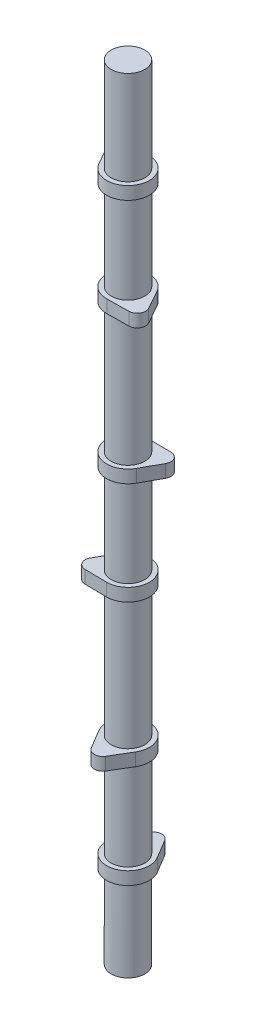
ISO-10303-21;
HEADER;
FILE_DESCRIPTION(('STEP AP214'),'2;1');
FILE_NAME('part.step','',(''),(''),'','','');
FILE_SCHEMA(('AUTOMOTIVE_DESIGN { 1 0 10303 214 1 1 1 1 }'));
ENDSEC;
DATA;
#1=APPLICATION_CONTEXT('core data for automotive mechanical design processes');
#2=APPLICATION_PROTOCOL_DEFINITION('international standard','automotive_design',2000,#1);
#3=PRODUCT_CONTEXT('',#1,'mechanical');
#4=PRODUCT('Part','Part','',(#3));
#5=PRODUCT_RELATED_PRODUCT_CATEGORY('part','',(#4));
#6=PRODUCT_DEFINITION_FORMATION('','',#4);
#7=PRODUCT_DEFINITION_CONTEXT('part definition',#1,'design');
#8=PRODUCT_DEFINITION('design','',#6,#7);
#9=PRODUCT_DEFINITION_SHAPE('','',#8);
#10=(LENGTH_UNIT() NAMED_UNIT(*) SI_UNIT(.MILLI.,.METRE.));
#11=(NAMED_UNIT(*) PLANE_ANGLE_UNIT() SI_UNIT($,.RADIAN.));
#12=(NAMED_UNIT(*) SI_UNIT($,.STERADIAN.) SOLID_ANGLE_UNIT());
#13=UNCERTAINTY_MEASURE_WITH_UNIT(LENGTH_MEASURE(1.E-05),#10,'distance_accuracy_value','');
#14=(GEOMETRIC_REPRESENTATION_CONTEXT(3) GLOBAL_UNCERTAINTY_ASSIGNED_CONTEXT((#13)) GLOBAL_UNIT_ASSIGNED_CONTEXT((#10,
#11,#12)) REPRESENTATION_CONTEXT('',''));
#15=CARTESIAN_POINT('',(0.,0.,0.));
#16=DIRECTION('',(0.,0.,1.));
#17=DIRECTION('',(1.,0.,0.));
#18=AXIS2_PLACEMENT_3D('',#15,#16,#17);
#19=CARTESIAN_POINT('',(0.,266.7,0.));
#20=DIRECTION('',(0.,-1.,0.));
#21=DIRECTION('',(-0.866025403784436,0.,0.500000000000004));
#22=AXIS2_PLACEMENT_3D('',#19,#20,#21);
#23=CYLINDRICAL_SURFACE('',#22,10.);
#24=CARTESIAN_POINT('',(0.,210.82,0.));
#25=DIRECTION('',(0.,1.,0.));
#26=DIRECTION('',(0.866025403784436,0.,-0.500000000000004));
#27=AXIS2_PLACEMENT_3D('',#24,#25,#26);
#28=CIRCLE('',#27,10.);
#29=CARTESIAN_POINT('',(8.66025403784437,210.82,-5.00000000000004));
#30=VERTEX_POINT('',#29);
#31=EDGE_CURVE('E389',#30,#30,#28,.F.);
#32=ORIENTED_EDGE('',*,*,#31,.F.);
#33=EDGE_LOOP('',(#32));
#34=FACE_BOUND('',#33,.T.);
#35=CARTESIAN_POINT('',(0.,288.29,0.));
#36=DIRECTION('',(0.,1.,0.));
#37=DIRECTION('',(-0.866025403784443,0.,-0.499999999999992));
#38=AXIS2_PLACEMENT_3D('',#35,#36,#37);
#39=CIRCLE('',#38,10.);
#40=CARTESIAN_POINT('',(-8.66025403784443,288.29,-4.99999999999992));
#41=VERTEX_POINT('',#40);
#42=EDGE_CURVE('E284',#41,#41,#39,.T.);
#43=ORIENTED_EDGE('',*,*,#42,.F.);
#44=EDGE_LOOP('',(#43));
#45=FACE_BOUND('',#44,.T.);
#46=ADVANCED_FACE('F37',(#34,#45),#23,.T.);
#47=CARTESIAN_POINT('',(12.9903810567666,210.82,-7.49999999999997));
#48=DIRECTION('',(0.,1.,0.));
#49=DIRECTION('',(-0.86602540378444,0.,0.499999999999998));
#50=AXIS2_PLACEMENT_3D('',#47,#48,#49);
#51=PLANE('',#50);
#52=CARTESIAN_POINT('',(12.9903810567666,210.82,-7.49999999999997));
#53=DIRECTION('',(0.,1.,0.));
#54=DIRECTION('',(-0.86602540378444,0.,0.499999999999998));
#55=AXIS2_PLACEMENT_3D('',#52,#53,#54);
#56=CIRCLE('',#55,5.);
#57=CARTESIAN_POINT('',(17.358652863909,210.82,-5.06726462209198));
#58=VERTEX_POINT('',#57);
#59=CARTESIAN_POINT('',(13.0677063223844,210.82,-12.4994020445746));
#60=VERTEX_POINT('',#59);
#61=EDGE_CURVE('E393',#58,#60,#56,.T.);
#62=ORIENTED_EDGE('',*,*,#61,.T.);
#63=DIRECTION('',(-0.999880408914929,0.,-0.0154650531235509));
#64=VECTOR('',#63,1.);
#65=CARTESIAN_POINT('',(13.0677063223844,210.82,-12.4994020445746));
#66=LINE('',#65,#64);
#67=CARTESIAN_POINT('',(0.196406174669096,210.82,-12.6984811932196));
#68=VERTEX_POINT('',#67);
#69=EDGE_CURVE('E87',#60,#68,#66,.T.);
#70=ORIENTED_EDGE('',*,*,#69,.T.);
#71=CARTESIAN_POINT('',(0.,210.82,0.));
#72=DIRECTION('',(0.,1.,0.));
#73=DIRECTION('',(-0.86602540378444,0.,0.499999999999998));
#74=AXIS2_PLACEMENT_3D('',#71,#72,#73);
#75=CIRCLE('',#74,12.7);
#76=CARTESIAN_POINT('',(11.0954103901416,210.82,6.1791478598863));
#77=VERTEX_POINT('',#76);
#78=EDGE_CURVE('E396',#68,#77,#75,.T.);
#79=ORIENTED_EDGE('',*,*,#78,.T.);
#80=DIRECTION('',(0.486547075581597,0.,-0.873654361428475));
#81=VECTOR('',#80,1.);
#82=CARTESIAN_POINT('',(17.358652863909,210.82,-5.06726462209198));
#83=LINE('',#82,#81);
#84=EDGE_CURVE('E55',#77,#58,#83,.T.);
#85=ORIENTED_EDGE('',*,*,#84,.T.);
#86=EDGE_LOOP('',(#62,#70,#79,#85));
#87=FACE_BOUND('',#86,.T.);
#88=ORIENTED_EDGE('',*,*,#31,.T.);
#89=EDGE_LOOP('',(#88));
#90=FACE_BOUND('',#89,.T.);
#91=ADVANCED_FACE('F422',(#87,#90),#51,.T.);
#92=CARTESIAN_POINT('',(13.0677063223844,210.82,-12.4994020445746));
#93=DIRECTION('',(-0.0154650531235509,0.,0.999880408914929));
#94=DIRECTION('',(0.999880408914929,0.,0.0154650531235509));
#95=AXIS2_PLACEMENT_3D('',#92,#93,#94);
#96=PLANE('',#95);
#97=DIRECTION('',(-0.999880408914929,0.,-0.0154650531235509));
#98=VECTOR('',#97,1.);
#99=CARTESIAN_POINT('',(13.0677063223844,203.2,-12.4994020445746));
#100=LINE('',#99,#98);
#101=CARTESIAN_POINT('',(13.0677063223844,203.2,-12.4994020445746));
#102=VERTEX_POINT('',#101);
#103=CARTESIAN_POINT('',(0.196406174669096,203.2,-12.6984811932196));
#104=VERTEX_POINT('',#103);
#105=EDGE_CURVE('E402',#102,#104,#100,.T.);
#106=ORIENTED_EDGE('',*,*,#105,.T.);
#107=DIRECTION('',(0.,-1.,0.));
#108=VECTOR('',#107,1.);
#109=CARTESIAN_POINT('',(0.196406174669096,210.82,-12.6984811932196));
#110=LINE('',#109,#108);
#111=EDGE_CURVE('E409',#68,#104,#110,.T.);
#112=ORIENTED_EDGE('',*,*,#111,.F.);
#113=ORIENTED_EDGE('',*,*,#69,.F.);
#114=DIRECTION('',(0.,-1.,0.));
#115=VECTOR('',#114,1.);
#116=CARTESIAN_POINT('',(13.0677063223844,210.82,-12.4994020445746));
#117=LINE('',#116,#115);
#118=EDGE_CURVE('E411',#60,#102,#117,.T.);
#119=ORIENTED_EDGE('',*,*,#118,.T.);
#120=EDGE_LOOP('',(#106,#112,#113,#119));
#121=FACE_BOUND('',#120,.T.);
#122=ADVANCED_FACE('F433',(#121),#96,.F.);
#123=CARTESIAN_POINT('',(0.,210.82,0.));
#124=DIRECTION('',(0.,-1.,0.));
#125=DIRECTION('',(0.86602540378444,0.,-0.499999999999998));
#126=AXIS2_PLACEMENT_3D('',#123,#124,#125);
#127=CYLINDRICAL_SURFACE('',#126,12.7);
#128=CARTESIAN_POINT('',(0.,203.2,0.));
#129=DIRECTION('',(0.,1.,0.));
#130=DIRECTION('',(-0.86602540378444,0.,0.499999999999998));
#131=AXIS2_PLACEMENT_3D('',#128,#129,#130);
#132=CIRCLE('',#131,12.7);
#133=CARTESIAN_POINT('',(11.0954103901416,203.2,6.1791478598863));
#134=VERTEX_POINT('',#133);
#135=EDGE_CURVE('E73',#104,#134,#132,.T.);
#136=ORIENTED_EDGE('',*,*,#135,.T.);
#137=DIRECTION('',(0.,-1.,0.));
#138=VECTOR('',#137,1.);
#139=CARTESIAN_POINT('',(11.0954103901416,210.82,6.1791478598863));
#140=LINE('',#139,#138);
#141=EDGE_CURVE('E407',#77,#134,#140,.T.);
#142=ORIENTED_EDGE('',*,*,#141,.F.);
#143=ORIENTED_EDGE('',*,*,#78,.F.);
#144=ORIENTED_EDGE('',*,*,#111,.T.);
#145=EDGE_LOOP('',(#136,#142,#143,#144));
#146=FACE_BOUND('',#145,.T.);
#147=ADVANCED_FACE('F442',(#146),#127,.T.);
#148=CARTESIAN_POINT('',(17.358652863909,210.82,-5.06726462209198));
#149=DIRECTION('',(-0.873654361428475,0.,-0.486547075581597));
#150=DIRECTION('',(-0.486547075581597,0.,0.873654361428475));
#151=AXIS2_PLACEMENT_3D('',#148,#149,#150);
#152=PLANE('',#151);
#153=DIRECTION('',(0.486547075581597,0.,-0.873654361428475));
#154=VECTOR('',#153,1.);
#155=CARTESIAN_POINT('',(17.358652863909,203.2,-5.06726462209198));
#156=LINE('',#155,#154);
#157=CARTESIAN_POINT('',(17.358652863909,203.2,-5.06726462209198));
#158=VERTEX_POINT('',#157);
#159=EDGE_CURVE('E79',#134,#158,#156,.T.);
#160=ORIENTED_EDGE('',*,*,#159,.T.);
#161=DIRECTION('',(0.,-1.,0.));
#162=VECTOR('',#161,1.);
#163=CARTESIAN_POINT('',(17.358652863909,210.82,-5.06726462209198));
#164=LINE('',#163,#162);
#165=EDGE_CURVE('E399',#58,#158,#164,.T.);
#166=ORIENTED_EDGE('',*,*,#165,.F.);
#167=ORIENTED_EDGE('',*,*,#84,.F.);
#168=ORIENTED_EDGE('',*,*,#141,.T.);
#169=EDGE_LOOP('',(#160,#166,#167,#168));
#170=FACE_BOUND('',#169,.T.);
#171=ADVANCED_FACE('F431',(#170),#152,.F.);
#172=CARTESIAN_POINT('',(12.9903810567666,210.82,-7.49999999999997));
#173=DIRECTION('',(0.,-1.,0.));
#174=DIRECTION('',(0.86602540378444,0.,-0.499999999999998));
#175=AXIS2_PLACEMENT_3D('',#172,#173,#174);
#176=CYLINDRICAL_SURFACE('',#175,5.);
#177=CARTESIAN_POINT('',(12.9903810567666,203.2,-7.49999999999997));
#178=DIRECTION('',(0.,1.,0.));
#179=DIRECTION('',(-0.86602540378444,0.,0.499999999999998));
#180=AXIS2_PLACEMENT_3D('',#177,#178,#179);
#181=CIRCLE('',#180,5.);
#182=EDGE_CURVE('E392',#158,#102,#181,.T.);
#183=ORIENTED_EDGE('',*,*,#182,.T.);
#184=ORIENTED_EDGE('',*,*,#118,.F.);
#185=ORIENTED_EDGE('',*,*,#61,.F.);
#186=ORIENTED_EDGE('',*,*,#165,.T.);
#187=EDGE_LOOP('',(#183,#184,#185,#186));
#188=FACE_BOUND('',#187,.T.);
#189=ADVANCED_FACE('F39',(#188),#176,.T.);
#190=CARTESIAN_POINT('',(12.9903810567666,203.2,-7.49999999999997));
#191=DIRECTION('',(0.,1.,0.));
#192=DIRECTION('',(-0.86602540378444,0.,0.499999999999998));
#193=AXIS2_PLACEMENT_3D('',#190,#191,#192);
#194=PLANE('',#193);
#195=ORIENTED_EDGE('',*,*,#182,.F.);
#196=ORIENTED_EDGE('',*,*,#159,.F.);
#197=ORIENTED_EDGE('',*,*,#135,.F.);
#198=ORIENTED_EDGE('',*,*,#105,.F.);
#199=EDGE_LOOP('',(#195,#196,#197,#198));
#200=FACE_BOUND('',#199,.T.);
#201=CARTESIAN_POINT('',(0.,203.2,0.));
#202=DIRECTION('',(0.,1.,0.));
#203=DIRECTION('',(0.866025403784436,0.,-0.500000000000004));
#204=AXIS2_PLACEMENT_3D('',#201,#202,#203);
#205=CIRCLE('',#204,10.);
#206=CARTESIAN_POINT('',(8.66025403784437,203.2,-5.00000000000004));
#207=VERTEX_POINT('',#206);
#208=EDGE_CURVE('E47',#207,#207,#205,.F.);
#209=ORIENTED_EDGE('',*,*,#208,.F.);
#210=EDGE_LOOP('',(#209));
#211=FACE_BOUND('',#210,.T.);
#212=ADVANCED_FACE('F418',(#200,#211),#194,.F.);
#213=CARTESIAN_POINT('',(0.,149.86,0.));
#214=DIRECTION('',(0.,1.,0.));
#215=DIRECTION('',(0.866025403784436,0.,-0.500000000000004));
#216=AXIS2_PLACEMENT_3D('',#213,#214,#215);
#217=CIRCLE('',#216,10.);
#218=CARTESIAN_POINT('',(8.66025403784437,149.86,-5.00000000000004));
#219=VERTEX_POINT('',#218);
#220=EDGE_CURVE('E41',#219,#219,#217,.T.);
#221=ORIENTED_EDGE('',*,*,#220,.T.);
#222=EDGE_LOOP('',(#221));
#223=FACE_BOUND('',#222,.T.);
#224=ORIENTED_EDGE('',*,*,#208,.T.);
#225=EDGE_LOOP('',(#224));
#226=FACE_BOUND('',#225,.T.);
#227=ADVANCED_FACE('F416',(#223,#226),#23,.T.);
#228=CARTESIAN_POINT('',(-12.9903810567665,149.86,7.50000000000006));
#229=DIRECTION('',(0.,1.,0.));
#230=DIRECTION('',(0.866025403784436,0.,-0.500000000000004));
#231=AXIS2_PLACEMENT_3D('',#228,#229,#230);
#232=PLANE('',#231);
#233=CARTESIAN_POINT('',(-12.9903810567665,149.86,7.50000000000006));
#234=DIRECTION('',(0.,1.,0.));
#235=DIRECTION('',(0.866025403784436,0.,-0.500000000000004));
#236=AXIS2_PLACEMENT_3D('',#233,#234,#235);
#237=CIRCLE('',#236,5.);
#238=CARTESIAN_POINT('',(-17.3586528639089,149.86,5.0672646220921));
#239=VERTEX_POINT('',#238);
#240=CARTESIAN_POINT('',(-13.0677063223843,149.86,12.4994020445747));
#241=VERTEX_POINT('',#240);
#242=EDGE_CURVE('E360',#239,#241,#237,.T.);
#243=ORIENTED_EDGE('',*,*,#242,.T.);
#244=DIRECTION('',(0.999880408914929,0.,0.015465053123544));
#245=VECTOR('',#244,1.);
#246=CARTESIAN_POINT('',(-13.0677063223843,149.86,12.4994020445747));
#247=LINE('',#246,#245);
#248=CARTESIAN_POINT('',(-0.196406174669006,149.86,12.6984811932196));
#249=VERTEX_POINT('',#248);
#250=EDGE_CURVE('E363',#241,#249,#247,.T.);
#251=ORIENTED_EDGE('',*,*,#250,.T.);
#252=CARTESIAN_POINT('',(0.,149.86,0.));
#253=DIRECTION('',(0.,1.,0.));
#254=DIRECTION('',(0.866025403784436,0.,-0.500000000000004));
#255=AXIS2_PLACEMENT_3D('',#252,#253,#254);
#256=CIRCLE('',#255,12.7);
#257=CARTESIAN_POINT('',(-11.0954103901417,149.86,-6.17914785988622));
#258=VERTEX_POINT('',#257);
#259=EDGE_CURVE('E366',#249,#258,#256,.T.);
#260=ORIENTED_EDGE('',*,*,#259,.T.);
#261=DIRECTION('',(-0.486547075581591,0.,0.873654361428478));
#262=VECTOR('',#261,1.);
#263=CARTESIAN_POINT('',(-17.3586528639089,149.86,5.0672646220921));
#264=LINE('',#263,#262);
#265=EDGE_CURVE('E368',#258,#239,#264,.T.);
#266=ORIENTED_EDGE('',*,*,#265,.T.);
#267=EDGE_LOOP('',(#243,#251,#260,#266));
#268=FACE_BOUND('',#267,.T.);
#269=ORIENTED_EDGE('',*,*,#220,.F.);
#270=EDGE_LOOP('',(#269));
#271=FACE_BOUND('',#270,.T.);
#272=ADVANCED_FACE('F427',(#268,#271),#232,.T.);
#273=CARTESIAN_POINT('',(-13.0677063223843,149.86,12.4994020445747));
#274=DIRECTION('',(0.015465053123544,0.,-0.999880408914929));
#275=DIRECTION('',(-0.999880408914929,0.,-0.015465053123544));
#276=AXIS2_PLACEMENT_3D('',#273,#274,#275);
#277=PLANE('',#276);
#278=DIRECTION('',(0.999880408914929,0.,0.015465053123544));
#279=VECTOR('',#278,1.);
#280=CARTESIAN_POINT('',(-13.0677063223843,142.24,12.4994020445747));
#281=LINE('',#280,#279);
#282=CARTESIAN_POINT('',(-13.0677063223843,142.24,12.4994020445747));
#283=VERTEX_POINT('',#282);
#284=CARTESIAN_POINT('',(-0.196406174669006,142.24,12.6984811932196));
#285=VERTEX_POINT('',#284);
#286=EDGE_CURVE('E373',#283,#285,#281,.T.);
#287=ORIENTED_EDGE('',*,*,#286,.T.);
#288=DIRECTION('',(0.,-1.,0.));
#289=VECTOR('',#288,1.);
#290=CARTESIAN_POINT('',(-0.196406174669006,149.86,12.6984811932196));
#291=LINE('',#290,#289);
#292=EDGE_CURVE('E383',#249,#285,#291,.T.);
#293=ORIENTED_EDGE('',*,*,#292,.F.);
#294=ORIENTED_EDGE('',*,*,#250,.F.);
#295=DIRECTION('',(0.,-1.,0.));
#296=VECTOR('',#295,1.);
#297=CARTESIAN_POINT('',(-13.0677063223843,149.86,12.4994020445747));
#298=LINE('',#297,#296);
#299=EDGE_CURVE('E386',#241,#283,#298,.T.);
#300=ORIENTED_EDGE('',*,*,#299,.T.);
#301=EDGE_LOOP('',(#287,#293,#294,#300));
#302=FACE_BOUND('',#301,.T.);
#303=ADVANCED_FACE('F452',(#302),#277,.F.);
#304=CARTESIAN_POINT('',(0.,149.86,0.));
#305=DIRECTION('',(0.,-1.,0.));
#306=DIRECTION('',(-0.866025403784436,0.,0.500000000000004));
#307=AXIS2_PLACEMENT_3D('',#304,#305,#306);
#308=CYLINDRICAL_SURFACE('',#307,12.7);
#309=CARTESIAN_POINT('',(0.,142.24,0.));
#310=DIRECTION('',(0.,1.,0.));
#311=DIRECTION('',(0.866025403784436,0.,-0.500000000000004));
#312=AXIS2_PLACEMENT_3D('',#309,#310,#311);
#313=CIRCLE('',#312,12.7);
#314=CARTESIAN_POINT('',(-11.0954103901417,142.24,-6.17914785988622));
#315=VERTEX_POINT('',#314);
#316=EDGE_CURVE('E375',#285,#315,#313,.T.);
#317=ORIENTED_EDGE('',*,*,#316,.T.);
#318=DIRECTION('',(0.,-1.,0.));
#319=VECTOR('',#318,1.);
#320=CARTESIAN_POINT('',(-11.0954103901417,149.86,-6.17914785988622));
#321=LINE('',#320,#319);
#322=EDGE_CURVE('E380',#258,#315,#321,.T.);
#323=ORIENTED_EDGE('',*,*,#322,.F.);
#324=ORIENTED_EDGE('',*,*,#259,.F.);
#325=ORIENTED_EDGE('',*,*,#292,.T.);
#326=EDGE_LOOP('',(#317,#323,#324,#325));
#327=FACE_BOUND('',#326,.T.);
#328=ADVANCED_FACE('F455',(#327),#308,.T.);
#329=CARTESIAN_POINT('',(-17.3586528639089,149.86,5.0672646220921));
#330=DIRECTION('',(0.873654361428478,0.,0.486547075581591));
#331=DIRECTION('',(0.486547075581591,0.,-0.873654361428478));
#332=AXIS2_PLACEMENT_3D('',#329,#330,#331);
#333=PLANE('',#332);
#334=DIRECTION('',(-0.486547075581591,0.,0.873654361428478));
#335=VECTOR('',#334,1.);
#336=CARTESIAN_POINT('',(-17.3586528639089,142.24,5.0672646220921));
#337=LINE('',#336,#335);
#338=CARTESIAN_POINT('',(-17.3586528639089,142.24,5.0672646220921));
#339=VERTEX_POINT('',#338);
#340=EDGE_CURVE('E364',#315,#339,#337,.T.);
#341=ORIENTED_EDGE('',*,*,#340,.T.);
#342=DIRECTION('',(0.,-1.,0.));
#343=VECTOR('',#342,1.);
#344=CARTESIAN_POINT('',(-17.3586528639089,149.86,5.0672646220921));
#345=LINE('',#344,#343);
#346=EDGE_CURVE('E370',#239,#339,#345,.T.);
#347=ORIENTED_EDGE('',*,*,#346,.F.);
#348=ORIENTED_EDGE('',*,*,#265,.F.);
#349=ORIENTED_EDGE('',*,*,#322,.T.);
#350=EDGE_LOOP('',(#341,#347,#348,#349));
#351=FACE_BOUND('',#350,.T.);
#352=ADVANCED_FACE('F450',(#351),#333,.F.);
#353=CARTESIAN_POINT('',(-12.9903810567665,149.86,7.50000000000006));
#354=DIRECTION('',(0.,-1.,0.));
#355=DIRECTION('',(-0.866025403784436,0.,0.500000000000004));
#356=AXIS2_PLACEMENT_3D('',#353,#354,#355);
#357=CYLINDRICAL_SURFACE('',#356,5.);
#358=CARTESIAN_POINT('',(-12.9903810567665,142.24,7.50000000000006));
#359=DIRECTION('',(0.,1.,0.));
#360=DIRECTION('',(0.866025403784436,0.,-0.500000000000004));
#361=AXIS2_PLACEMENT_3D('',#358,#359,#360);
#362=CIRCLE('',#361,5.);
#363=EDGE_CURVE('E352',#339,#283,#362,.T.);
#364=ORIENTED_EDGE('',*,*,#363,.T.);
#365=ORIENTED_EDGE('',*,*,#299,.F.);
#366=ORIENTED_EDGE('',*,*,#242,.F.);
#367=ORIENTED_EDGE('',*,*,#346,.T.);
#368=EDGE_LOOP('',(#364,#365,#366,#367));
#369=FACE_BOUND('',#368,.T.);
#370=ADVANCED_FACE('F446',(#369),#357,.T.);
#371=CARTESIAN_POINT('',(-12.9903810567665,142.24,7.50000000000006));
#372=DIRECTION('',(0.,1.,0.));
#373=DIRECTION('',(0.866025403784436,0.,-0.500000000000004));
#374=AXIS2_PLACEMENT_3D('',#371,#372,#373);
#375=PLANE('',#374);
#376=ORIENTED_EDGE('',*,*,#363,.F.);
#377=ORIENTED_EDGE('',*,*,#340,.F.);
#378=ORIENTED_EDGE('',*,*,#316,.F.);
#379=ORIENTED_EDGE('',*,*,#286,.F.);
#380=EDGE_LOOP('',(#376,#377,#378,#379));
#381=FACE_BOUND('',#380,.T.);
#382=CARTESIAN_POINT('',(0.,142.24,0.));
#383=DIRECTION('',(0.,1.,0.));
#384=DIRECTION('',(0.866025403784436,0.,-0.500000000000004));
#385=AXIS2_PLACEMENT_3D('',#382,#383,#384);
#386=CIRCLE('',#385,10.);
#387=CARTESIAN_POINT('',(8.66025403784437,142.24,-5.00000000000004));
#388=VERTEX_POINT('',#387);
#389=EDGE_CURVE('E11',#388,#388,#386,.T.);
#390=ORIENTED_EDGE('',*,*,#389,.T.);
#391=EDGE_LOOP('',(#390));
#392=FACE_BOUND('',#391,.T.);
#393=ADVANCED_FACE('F449',(#381,#392),#375,.F.);
#394=ORIENTED_EDGE('',*,*,#389,.F.);
#395=EDGE_LOOP('',(#394));
#396=FACE_BOUND('',#395,.T.);
#397=CARTESIAN_POINT('',(0.,64.77,0.));
#398=DIRECTION('',(0.,1.,0.));
#399=DIRECTION('',(0.,0.,1.));
#400=AXIS2_PLACEMENT_3D('',#397,#398,#399);
#401=CIRCLE('',#400,10.);
#402=CARTESIAN_POINT('',(0.,64.77,10.));
#403=VERTEX_POINT('',#402);
#404=EDGE_CURVE('E237',#403,#403,#401,.F.);
#405=ORIENTED_EDGE('',*,*,#404,.F.);
#406=EDGE_LOOP('',(#405));
#407=FACE_BOUND('',#406,.T.);
#408=ADVANCED_FACE('F430',(#396,#407),#23,.T.);
#409=CARTESIAN_POINT('',(0.,412.75,0.));
#410=DIRECTION('',(0.,1.,0.));
#411=DIRECTION('',(-0.866025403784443,0.,-0.499999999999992));
#412=AXIS2_PLACEMENT_3D('',#409,#410,#411);
#413=PLANE('',#412);
#414=CARTESIAN_POINT('',(0.,412.75,0.));
#415=DIRECTION('',(0.,1.,0.));
#416=DIRECTION('',(-0.866025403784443,0.,-0.499999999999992));
#417=AXIS2_PLACEMENT_3D('',#414,#415,#416);
#418=CIRCLE('',#417,10.);
#419=CARTESIAN_POINT('',(-8.66025403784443,412.75,-4.99999999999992));
#420=VERTEX_POINT('',#419);
#421=EDGE_CURVE('E289',#420,#420,#418,.T.);
#422=ORIENTED_EDGE('',*,*,#421,.T.);
#423=EDGE_LOOP('',(#422));
#424=FACE_BOUND('',#423,.T.);
#425=ADVANCED_FACE('F475',(#424),#413,.T.);
#426=CARTESIAN_POINT('',(0.,412.75,0.));
#427=DIRECTION('',(0.,-1.,0.));
#428=DIRECTION('',(0.866025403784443,0.,0.499999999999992));
#429=AXIS2_PLACEMENT_3D('',#426,#427,#428);
#430=CYLINDRICAL_SURFACE('',#429,10.);
#431=CARTESIAN_POINT('',(0.,356.87,0.));
#432=DIRECTION('',(0.,1.,0.));
#433=DIRECTION('',(-0.866025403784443,0.,-0.499999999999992));
#434=AXIS2_PLACEMENT_3D('',#431,#432,#433);
#435=CIRCLE('',#434,10.);
#436=CARTESIAN_POINT('',(-8.66025403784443,356.87,-4.99999999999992));
#437=VERTEX_POINT('',#436);
#438=EDGE_CURVE('E318',#437,#437,#435,.F.);
#439=ORIENTED_EDGE('',*,*,#438,.F.);
#440=EDGE_LOOP('',(#439));
#441=FACE_BOUND('',#440,.T.);
#442=ORIENTED_EDGE('',*,*,#421,.F.);
#443=EDGE_LOOP('',(#442));
#444=FACE_BOUND('',#443,.T.);
#445=ADVANCED_FACE('F498',(#441,#444),#430,.T.);
#446=CARTESIAN_POINT('',(-12.9903810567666,356.87,-7.49999999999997));
#447=DIRECTION('',(0.,1.,0.));
#448=DIRECTION('',(0.86602540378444,0.,0.499999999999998));
#449=AXIS2_PLACEMENT_3D('',#446,#447,#448);
#450=PLANE('',#449);
#451=CARTESIAN_POINT('',(-12.9903810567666,356.87,-7.49999999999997));
#452=DIRECTION('',(0.,1.,0.));
#453=DIRECTION('',(0.86602540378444,0.,0.499999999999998));
#454=AXIS2_PLACEMENT_3D('',#451,#452,#453);
#455=CIRCLE('',#454,5.);
#456=CARTESIAN_POINT('',(-13.0677063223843,356.87,-12.4994020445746));
#457=VERTEX_POINT('',#456);
#458=CARTESIAN_POINT('',(-17.358652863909,356.87,-5.06726462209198));
#459=VERTEX_POINT('',#458);
#460=EDGE_CURVE('E311',#457,#459,#455,.T.);
#461=ORIENTED_EDGE('',*,*,#460,.T.);
#462=DIRECTION('',(0.486547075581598,0.,0.873654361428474));
#463=VECTOR('',#462,1.);
#464=CARTESIAN_POINT('',(-17.358652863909,356.87,-5.06726462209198));
#465=LINE('',#464,#463);
#466=CARTESIAN_POINT('',(-11.0954103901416,356.87,6.17914785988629));
#467=VERTEX_POINT('',#466);
#468=EDGE_CURVE('E322',#459,#467,#465,.T.);
#469=ORIENTED_EDGE('',*,*,#468,.T.);
#470=CARTESIAN_POINT('',(0.,356.87,0.));
#471=DIRECTION('',(0.,1.,0.));
#472=DIRECTION('',(0.86602540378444,0.,0.499999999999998));
#473=AXIS2_PLACEMENT_3D('',#470,#471,#472);
#474=CIRCLE('',#473,12.7);
#475=CARTESIAN_POINT('',(-0.19640617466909,356.87,-12.6984811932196));
#476=VERTEX_POINT('',#475);
#477=EDGE_CURVE('E320',#467,#476,#474,.T.);
#478=ORIENTED_EDGE('',*,*,#477,.T.);
#479=DIRECTION('',(-0.999880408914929,0.,0.0154650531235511));
#480=VECTOR('',#479,1.);
#481=CARTESIAN_POINT('',(-13.0677063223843,356.87,-12.4994020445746));
#482=LINE('',#481,#480);
#483=EDGE_CURVE('E307',#476,#457,#482,.T.);
#484=ORIENTED_EDGE('',*,*,#483,.T.);
#485=EDGE_LOOP('',(#461,#469,#478,#484));
#486=FACE_BOUND('',#485,.T.);
#487=ORIENTED_EDGE('',*,*,#438,.T.);
#488=EDGE_LOOP('',(#487));
#489=FACE_BOUND('',#488,.T.);
#490=ADVANCED_FACE('F502',(#486,#489),#450,.T.);
#491=CARTESIAN_POINT('',(-17.358652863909,356.87,-5.06726462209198));
#492=DIRECTION('',(0.873654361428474,0.,-0.486547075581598));
#493=DIRECTION('',(-0.486547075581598,0.,-0.873654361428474));
#494=AXIS2_PLACEMENT_3D('',#491,#492,#493);
#495=PLANE('',#494);
#496=DIRECTION('',(0.486547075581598,0.,0.873654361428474));
#497=VECTOR('',#496,1.);
#498=CARTESIAN_POINT('',(-17.358652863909,349.25,-5.06726462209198));
#499=LINE('',#498,#497);
#500=CARTESIAN_POINT('',(-17.358652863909,349.25,-5.06726462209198));
#501=VERTEX_POINT('',#500);
#502=CARTESIAN_POINT('',(-11.0954103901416,349.25,6.17914785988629));
#503=VERTEX_POINT('',#502);
#504=EDGE_CURVE('E313',#501,#503,#499,.T.);
#505=ORIENTED_EDGE('',*,*,#504,.T.);
#506=DIRECTION('',(0.,-1.,0.));
#507=VECTOR('',#506,1.);
#508=CARTESIAN_POINT('',(-11.0954103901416,356.87,6.17914785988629));
#509=LINE('',#508,#507);
#510=EDGE_CURVE('E298',#467,#503,#509,.T.);
#511=ORIENTED_EDGE('',*,*,#510,.F.);
#512=ORIENTED_EDGE('',*,*,#468,.F.);
#513=DIRECTION('',(0.,-1.,0.));
#514=VECTOR('',#513,1.);
#515=CARTESIAN_POINT('',(-17.358652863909,356.87,-5.06726462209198));
#516=LINE('',#515,#514);
#517=EDGE_CURVE('E295',#459,#501,#516,.T.);
#518=ORIENTED_EDGE('',*,*,#517,.T.);
#519=EDGE_LOOP('',(#505,#511,#512,#518));
#520=FACE_BOUND('',#519,.T.);
#521=ADVANCED_FACE('F506',(#520),#495,.F.);
#522=CARTESIAN_POINT('',(0.,356.87,0.));
#523=DIRECTION('',(0.,-1.,0.));
#524=DIRECTION('',(-0.86602540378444,0.,-0.499999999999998));
#525=AXIS2_PLACEMENT_3D('',#522,#523,#524);
#526=CYLINDRICAL_SURFACE('',#525,12.7);
#527=CARTESIAN_POINT('',(0.,349.25,0.));
#528=DIRECTION('',(0.,1.,0.));
#529=DIRECTION('',(0.86602540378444,0.,0.499999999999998));
#530=AXIS2_PLACEMENT_3D('',#527,#528,#529);
#531=CIRCLE('',#530,12.7);
#532=CARTESIAN_POINT('',(-0.19640617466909,349.25,-12.6984811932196));
#533=VERTEX_POINT('',#532);
#534=EDGE_CURVE('E310',#503,#533,#531,.T.);
#535=ORIENTED_EDGE('',*,*,#534,.T.);
#536=DIRECTION('',(0.,-1.,0.));
#537=VECTOR('',#536,1.);
#538=CARTESIAN_POINT('',(-0.19640617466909,356.87,-12.6984811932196));
#539=LINE('',#538,#537);
#540=EDGE_CURVE('E301',#476,#533,#539,.T.);
#541=ORIENTED_EDGE('',*,*,#540,.F.);
#542=ORIENTED_EDGE('',*,*,#477,.F.);
#543=ORIENTED_EDGE('',*,*,#510,.T.);
#544=EDGE_LOOP('',(#535,#541,#542,#543));
#545=FACE_BOUND('',#544,.T.);
#546=ADVANCED_FACE('F516',(#545),#526,.T.);
#547=CARTESIAN_POINT('',(-13.0677063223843,356.87,-12.4994020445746));
#548=DIRECTION('',(0.0154650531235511,0.,0.999880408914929));
#549=DIRECTION('',(0.999880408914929,0.,-0.0154650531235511));
#550=AXIS2_PLACEMENT_3D('',#547,#548,#549);
#551=PLANE('',#550);
#552=DIRECTION('',(-0.999880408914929,0.,0.0154650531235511));
#553=VECTOR('',#552,1.);
#554=CARTESIAN_POINT('',(-13.0677063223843,349.25,-12.4994020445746));
#555=LINE('',#554,#553);
#556=CARTESIAN_POINT('',(-13.0677063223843,349.25,-12.4994020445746));
#557=VERTEX_POINT('',#556);
#558=EDGE_CURVE('E308',#533,#557,#555,.T.);
#559=ORIENTED_EDGE('',*,*,#558,.T.);
#560=DIRECTION('',(0.,-1.,0.));
#561=VECTOR('',#560,1.);
#562=CARTESIAN_POINT('',(-13.0677063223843,356.87,-12.4994020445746));
#563=LINE('',#562,#561);
#564=EDGE_CURVE('E304',#457,#557,#563,.T.);
#565=ORIENTED_EDGE('',*,*,#564,.F.);
#566=ORIENTED_EDGE('',*,*,#483,.F.);
#567=ORIENTED_EDGE('',*,*,#540,.T.);
#568=EDGE_LOOP('',(#559,#565,#566,#567));
#569=FACE_BOUND('',#568,.T.);
#570=ADVANCED_FACE('F513',(#569),#551,.F.);
#571=CARTESIAN_POINT('',(-12.9903810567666,356.87,-7.49999999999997));
#572=DIRECTION('',(0.,-1.,0.));
#573=DIRECTION('',(-0.86602540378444,0.,-0.499999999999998));
#574=AXIS2_PLACEMENT_3D('',#571,#572,#573);
#575=CYLINDRICAL_SURFACE('',#574,5.);
#576=CARTESIAN_POINT('',(-12.9903810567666,349.25,-7.49999999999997));
#577=DIRECTION('',(0.,1.,0.));
#578=DIRECTION('',(0.86602540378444,0.,0.499999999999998));
#579=AXIS2_PLACEMENT_3D('',#576,#577,#578);
#580=CIRCLE('',#579,5.);
#581=EDGE_CURVE('E315',#557,#501,#580,.T.);
#582=ORIENTED_EDGE('',*,*,#581,.T.);
#583=ORIENTED_EDGE('',*,*,#517,.F.);
#584=ORIENTED_EDGE('',*,*,#460,.F.);
#585=ORIENTED_EDGE('',*,*,#564,.T.);
#586=EDGE_LOOP('',(#582,#583,#584,#585));
#587=FACE_BOUND('',#586,.T.);
#588=ADVANCED_FACE('F511',(#587),#575,.T.);
#589=CARTESIAN_POINT('',(-12.9903810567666,349.25,-7.49999999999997));
#590=DIRECTION('',(0.,1.,0.));
#591=DIRECTION('',(0.86602540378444,0.,0.499999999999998));
#592=AXIS2_PLACEMENT_3D('',#589,#590,#591);
#593=PLANE('',#592);
#594=ORIENTED_EDGE('',*,*,#581,.F.);
#595=ORIENTED_EDGE('',*,*,#558,.F.);
#596=ORIENTED_EDGE('',*,*,#534,.F.);
#597=ORIENTED_EDGE('',*,*,#504,.F.);
#598=EDGE_LOOP('',(#594,#595,#596,#597));
#599=FACE_BOUND('',#598,.T.);
#600=CARTESIAN_POINT('',(0.,349.25,0.));
#601=DIRECTION('',(0.,1.,0.));
#602=DIRECTION('',(-0.866025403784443,0.,-0.499999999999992));
#603=AXIS2_PLACEMENT_3D('',#600,#601,#602);
#604=CIRCLE('',#603,10.);
#605=CARTESIAN_POINT('',(-8.66025403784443,349.25,-4.99999999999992));
#606=VERTEX_POINT('',#605);
#607=EDGE_CURVE('E292',#606,#606,#604,.F.);
#608=ORIENTED_EDGE('',*,*,#607,.F.);
#609=EDGE_LOOP('',(#608));
#610=FACE_BOUND('',#609,.T.);
#611=ADVANCED_FACE('F508',(#599,#610),#593,.F.);
#612=CARTESIAN_POINT('',(0.,295.91,0.));
#613=DIRECTION('',(0.,1.,0.));
#614=DIRECTION('',(-0.866025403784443,0.,-0.499999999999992));
#615=AXIS2_PLACEMENT_3D('',#612,#613,#614);
#616=CIRCLE('',#615,10.);
#617=CARTESIAN_POINT('',(-8.66025403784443,295.91,-4.99999999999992));
#618=VERTEX_POINT('',#617);
#619=EDGE_CURVE('E285',#618,#618,#616,.T.);
#620=ORIENTED_EDGE('',*,*,#619,.T.);
#621=EDGE_LOOP('',(#620));
#622=FACE_BOUND('',#621,.T.);
#623=ORIENTED_EDGE('',*,*,#607,.T.);
#624=EDGE_LOOP('',(#623));
#625=FACE_BOUND('',#624,.T.);
#626=ADVANCED_FACE('F473',(#622,#625),#430,.T.);
#627=CARTESIAN_POINT('',(12.9903810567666,295.91,7.49999999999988));
#628=DIRECTION('',(0.,1.,0.));
#629=DIRECTION('',(-0.866025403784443,0.,-0.499999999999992));
#630=AXIS2_PLACEMENT_3D('',#627,#628,#629);
#631=PLANE('',#630);
#632=CARTESIAN_POINT('',(12.9903810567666,295.91,7.49999999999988));
#633=DIRECTION('',(0.,1.,0.));
#634=DIRECTION('',(-0.866025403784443,0.,-0.499999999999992));
#635=AXIS2_PLACEMENT_3D('',#632,#633,#634);
#636=CIRCLE('',#635,5.);
#637=CARTESIAN_POINT('',(13.0677063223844,295.91,12.4994020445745));
#638=VERTEX_POINT('',#637);
#639=CARTESIAN_POINT('',(17.358652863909,295.91,5.06726462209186));
#640=VERTEX_POINT('',#639);
#641=EDGE_CURVE('E345',#638,#640,#636,.T.);
#642=ORIENTED_EDGE('',*,*,#641,.T.);
#643=DIRECTION('',(-0.486547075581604,0.,-0.873654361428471));
#644=VECTOR('',#643,1.);
#645=CARTESIAN_POINT('',(17.358652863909,295.91,5.06726462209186));
#646=LINE('',#645,#644);
#647=CARTESIAN_POINT('',(11.0954103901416,295.91,-6.17914785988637));
#648=VERTEX_POINT('',#647);
#649=EDGE_CURVE('E356',#640,#648,#646,.T.);
#650=ORIENTED_EDGE('',*,*,#649,.T.);
#651=CARTESIAN_POINT('',(0.,295.91,0.));
#652=DIRECTION('',(0.,1.,0.));
#653=DIRECTION('',(-0.866025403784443,0.,-0.499999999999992));
#654=AXIS2_PLACEMENT_3D('',#651,#652,#653);
#655=CIRCLE('',#654,12.7);
#656=CARTESIAN_POINT('',(0.196406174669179,295.91,12.6984811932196));
#657=VERTEX_POINT('',#656);
#658=EDGE_CURVE('E354',#648,#657,#655,.T.);
#659=ORIENTED_EDGE('',*,*,#658,.T.);
#660=DIRECTION('',(0.999880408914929,0.,-0.0154650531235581));
#661=VECTOR('',#660,1.);
#662=CARTESIAN_POINT('',(13.0677063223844,295.91,12.4994020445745));
#663=LINE('',#662,#661);
#664=EDGE_CURVE('E341',#657,#638,#663,.T.);
#665=ORIENTED_EDGE('',*,*,#664,.T.);
#666=EDGE_LOOP('',(#642,#650,#659,#665));
#667=FACE_BOUND('',#666,.T.);
#668=ORIENTED_EDGE('',*,*,#619,.F.);
#669=EDGE_LOOP('',(#668));
#670=FACE_BOUND('',#669,.T.);
#671=ADVANCED_FACE('F469',(#667,#670),#631,.T.);
#672=CARTESIAN_POINT('',(17.358652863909,295.91,5.06726462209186));
#673=DIRECTION('',(-0.873654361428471,0.,0.486547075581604));
#674=DIRECTION('',(0.486547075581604,0.,0.873654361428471));
#675=AXIS2_PLACEMENT_3D('',#672,#673,#674);
#676=PLANE('',#675);
#677=DIRECTION('',(-0.486547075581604,0.,-0.873654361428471));
#678=VECTOR('',#677,1.);
#679=CARTESIAN_POINT('',(17.358652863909,288.29,5.06726462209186));
#680=LINE('',#679,#678);
#681=CARTESIAN_POINT('',(17.358652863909,288.29,5.06726462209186));
#682=VERTEX_POINT('',#681);
#683=CARTESIAN_POINT('',(11.0954103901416,288.29,-6.17914785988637));
#684=VERTEX_POINT('',#683);
#685=EDGE_CURVE('E347',#682,#684,#680,.T.);
#686=ORIENTED_EDGE('',*,*,#685,.T.);
#687=DIRECTION('',(0.,-1.,0.));
#688=VECTOR('',#687,1.);
#689=CARTESIAN_POINT('',(11.0954103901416,295.91,-6.17914785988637));
#690=LINE('',#689,#688);
#691=EDGE_CURVE('E332',#648,#684,#690,.T.);
#692=ORIENTED_EDGE('',*,*,#691,.F.);
#693=ORIENTED_EDGE('',*,*,#649,.F.);
#694=DIRECTION('',(0.,-1.,0.));
#695=VECTOR('',#694,1.);
#696=CARTESIAN_POINT('',(17.358652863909,295.91,5.06726462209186));
#697=LINE('',#696,#695);
#698=EDGE_CURVE('E288',#640,#682,#697,.T.);
#699=ORIENTED_EDGE('',*,*,#698,.T.);
#700=EDGE_LOOP('',(#686,#692,#693,#699));
#701=FACE_BOUND('',#700,.T.);
#702=ADVANCED_FACE('F472',(#701),#676,.F.);
#703=CARTESIAN_POINT('',(0.,295.91,0.));
#704=DIRECTION('',(0.,-1.,0.));
#705=DIRECTION('',(0.866025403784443,0.,0.499999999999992));
#706=AXIS2_PLACEMENT_3D('',#703,#704,#705);
#707=CYLINDRICAL_SURFACE('',#706,12.7);
#708=CARTESIAN_POINT('',(0.,288.29,0.));
#709=DIRECTION('',(0.,1.,0.));
#710=DIRECTION('',(-0.866025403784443,0.,-0.499999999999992));
#711=AXIS2_PLACEMENT_3D('',#708,#709,#710);
#712=CIRCLE('',#711,12.7);
#713=CARTESIAN_POINT('',(0.196406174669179,288.29,12.6984811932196));
#714=VERTEX_POINT('',#713);
#715=EDGE_CURVE('E344',#684,#714,#712,.T.);
#716=ORIENTED_EDGE('',*,*,#715,.T.);
#717=DIRECTION('',(0.,-1.,0.));
#718=VECTOR('',#717,1.);
#719=CARTESIAN_POINT('',(0.196406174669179,295.91,12.6984811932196));
#720=LINE('',#719,#718);
#721=EDGE_CURVE('E335',#657,#714,#720,.T.);
#722=ORIENTED_EDGE('',*,*,#721,.F.);
#723=ORIENTED_EDGE('',*,*,#658,.F.);
#724=ORIENTED_EDGE('',*,*,#691,.T.);
#725=EDGE_LOOP('',(#716,#722,#723,#724));
#726=FACE_BOUND('',#725,.T.);
#727=ADVANCED_FACE('F485',(#726),#707,.T.);
#728=CARTESIAN_POINT('',(13.0677063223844,295.91,12.4994020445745));
#729=DIRECTION('',(-0.0154650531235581,0.,-0.999880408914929));
#730=DIRECTION('',(-0.999880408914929,0.,0.0154650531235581));
#731=AXIS2_PLACEMENT_3D('',#728,#729,#730);
#732=PLANE('',#731);
#733=DIRECTION('',(0.999880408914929,0.,-0.0154650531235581));
#734=VECTOR('',#733,1.);
#735=CARTESIAN_POINT('',(13.0677063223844,288.29,12.4994020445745));
#736=LINE('',#735,#734);
#737=CARTESIAN_POINT('',(13.0677063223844,288.29,12.4994020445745));
#738=VERTEX_POINT('',#737);
#739=EDGE_CURVE('E342',#714,#738,#736,.T.);
#740=ORIENTED_EDGE('',*,*,#739,.T.);
#741=DIRECTION('',(0.,-1.,0.));
#742=VECTOR('',#741,1.);
#743=CARTESIAN_POINT('',(13.0677063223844,295.91,12.4994020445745));
#744=LINE('',#743,#742);
#745=EDGE_CURVE('E338',#638,#738,#744,.T.);
#746=ORIENTED_EDGE('',*,*,#745,.F.);
#747=ORIENTED_EDGE('',*,*,#664,.F.);
#748=ORIENTED_EDGE('',*,*,#721,.T.);
#749=EDGE_LOOP('',(#740,#746,#747,#748));
#750=FACE_BOUND('',#749,.T.);
#751=ADVANCED_FACE('F482',(#750),#732,.F.);
#752=CARTESIAN_POINT('',(12.9903810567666,295.91,7.49999999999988));
#753=DIRECTION('',(0.,-1.,0.));
#754=DIRECTION('',(0.866025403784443,0.,0.499999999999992));
#755=AXIS2_PLACEMENT_3D('',#752,#753,#754);
#756=CYLINDRICAL_SURFACE('',#755,5.);
#757=CARTESIAN_POINT('',(12.9903810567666,288.29,7.49999999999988));
#758=DIRECTION('',(0.,1.,0.));
#759=DIRECTION('',(-0.866025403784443,0.,-0.499999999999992));
#760=AXIS2_PLACEMENT_3D('',#757,#758,#759);
#761=CIRCLE('',#760,5.);
#762=EDGE_CURVE('E349',#738,#682,#761,.T.);
#763=ORIENTED_EDGE('',*,*,#762,.T.);
#764=ORIENTED_EDGE('',*,*,#698,.F.);
#765=ORIENTED_EDGE('',*,*,#641,.F.);
#766=ORIENTED_EDGE('',*,*,#745,.T.);
#767=EDGE_LOOP('',(#763,#764,#765,#766));
#768=FACE_BOUND('',#767,.T.);
#769=ADVANCED_FACE('F480',(#768),#756,.T.);
#770=CARTESIAN_POINT('',(12.9903810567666,288.29,7.49999999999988));
#771=DIRECTION('',(0.,1.,0.));
#772=DIRECTION('',(-0.866025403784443,0.,-0.499999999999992));
#773=AXIS2_PLACEMENT_3D('',#770,#771,#772);
#774=PLANE('',#773);
#775=ORIENTED_EDGE('',*,*,#762,.F.);
#776=ORIENTED_EDGE('',*,*,#739,.F.);
#777=ORIENTED_EDGE('',*,*,#715,.F.);
#778=ORIENTED_EDGE('',*,*,#685,.F.);
#779=EDGE_LOOP('',(#775,#776,#777,#778));
#780=FACE_BOUND('',#779,.T.);
#781=ORIENTED_EDGE('',*,*,#42,.T.);
#782=EDGE_LOOP('',(#781));
#783=FACE_BOUND('',#782,.T.);
#784=ADVANCED_FACE('F476',(#780,#783),#774,.F.);
#785=CARTESIAN_POINT('',(-1.04744440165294E-13,64.77,15.));
#786=DIRECTION('',(0.,1.,0.));
#787=DIRECTION('',(0.,0.,-1.));
#788=AXIS2_PLACEMENT_3D('',#785,#786,#787);
#789=PLANE('',#788);
#790=CARTESIAN_POINT('',(-1.04744440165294E-13,64.77,15.));
#791=DIRECTION('',(0.,1.,0.));
#792=DIRECTION('',(0.,0.,-1.));
#793=AXIS2_PLACEMENT_3D('',#790,#791,#792);
#794=CIRCLE('',#793,5.);
#795=CARTESIAN_POINT('',(-4.29094654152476,64.77,17.5666666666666));
#796=VERTEX_POINT('',#795);
#797=CARTESIAN_POINT('',(4.29094654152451,64.77,17.5666666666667));
#798=VERTEX_POINT('',#797);
#799=EDGE_CURVE('E223',#796,#798,#794,.T.);
#800=ORIENTED_EDGE('',*,*,#799,.T.);
#801=DIRECTION('',(0.51333333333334,0.,-0.858189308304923));
#802=VECTOR('',#801,1.);
#803=CARTESIAN_POINT('',(4.29094654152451,64.77,17.5666666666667));
#804=LINE('',#803,#802);
#805=CARTESIAN_POINT('',(10.8990042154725,64.77,6.51933333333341));
#806=VERTEX_POINT('',#805);
#807=EDGE_CURVE('E248',#798,#806,#804,.T.);
#808=ORIENTED_EDGE('',*,*,#807,.T.);
#809=CARTESIAN_POINT('',(0.,64.77,0.));
#810=DIRECTION('',(0.,1.,0.));
#811=DIRECTION('',(0.,0.,-1.));
#812=AXIS2_PLACEMENT_3D('',#809,#810,#811);
#813=CIRCLE('',#812,12.7);
#814=CARTESIAN_POINT('',(-10.8990042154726,64.77,6.51933333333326));
#815=VERTEX_POINT('',#814);
#816=EDGE_CURVE('E246',#806,#815,#813,.T.);
#817=ORIENTED_EDGE('',*,*,#816,.T.);
#818=DIRECTION('',(0.513333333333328,0.,0.85818930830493));
#819=VECTOR('',#818,1.);
#820=CARTESIAN_POINT('',(-4.29094654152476,64.77,17.5666666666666));
#821=LINE('',#820,#819);
#822=EDGE_CURVE('E231',#815,#796,#821,.T.);
#823=ORIENTED_EDGE('',*,*,#822,.T.);
#824=EDGE_LOOP('',(#800,#808,#817,#823));
#825=FACE_BOUND('',#824,.T.);
#826=ORIENTED_EDGE('',*,*,#404,.T.);
#827=EDGE_LOOP('',(#826));
#828=FACE_BOUND('',#827,.T.);
#829=ADVANCED_FACE('F479',(#825,#828),#789,.T.);
#830=CARTESIAN_POINT('',(-1.04744440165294E-13,57.15,15.));
#831=DIRECTION('',(0.,1.,0.));
#832=DIRECTION('',(0.,0.,-1.));
#833=AXIS2_PLACEMENT_3D('',#830,#831,#832);
#834=PLANE('',#833);
#835=CARTESIAN_POINT('',(-1.04744440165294E-13,57.15,15.));
#836=DIRECTION('',(0.,1.,0.));
#837=DIRECTION('',(0.,0.,-1.));
#838=AXIS2_PLACEMENT_3D('',#835,#836,#837);
#839=CIRCLE('',#838,5.);
#840=CARTESIAN_POINT('',(-4.29094654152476,57.15,17.5666666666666));
#841=VERTEX_POINT('',#840);
#842=CARTESIAN_POINT('',(4.29094654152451,57.15,17.5666666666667));
#843=VERTEX_POINT('',#842);
#844=EDGE_CURVE('E229',#841,#843,#839,.T.);
#845=ORIENTED_EDGE('',*,*,#844,.F.);
#846=DIRECTION('',(0.513333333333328,0.,0.85818930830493));
#847=VECTOR('',#846,1.);
#848=CARTESIAN_POINT('',(-4.29094654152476,57.15,17.5666666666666));
#849=LINE('',#848,#847);
#850=CARTESIAN_POINT('',(-10.8990042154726,57.15,6.51933333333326));
#851=VERTEX_POINT('',#850);
#852=EDGE_CURVE('E211',#851,#841,#849,.T.);
#853=ORIENTED_EDGE('',*,*,#852,.F.);
#854=CARTESIAN_POINT('',(0.,57.15,0.));
#855=DIRECTION('',(0.,1.,0.));
#856=DIRECTION('',(0.,0.,-1.));
#857=AXIS2_PLACEMENT_3D('',#854,#855,#856);
#858=CIRCLE('',#857,12.7);
#859=CARTESIAN_POINT('',(10.8990042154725,57.15,6.51933333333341));
#860=VERTEX_POINT('',#859);
#861=EDGE_CURVE('E222',#860,#851,#858,.T.);
#862=ORIENTED_EDGE('',*,*,#861,.F.);
#863=DIRECTION('',(0.51333333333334,0.,-0.858189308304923));
#864=VECTOR('',#863,1.);
#865=CARTESIAN_POINT('',(4.29094654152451,57.15,17.5666666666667));
#866=LINE('',#865,#864);
#867=EDGE_CURVE('E235',#843,#860,#866,.T.);
#868=ORIENTED_EDGE('',*,*,#867,.F.);
#869=EDGE_LOOP('',(#845,#853,#862,#868));
#870=FACE_BOUND('',#869,.T.);
#871=CARTESIAN_POINT('',(0.,57.15,0.));
#872=DIRECTION('',(0.,1.,0.));
#873=DIRECTION('',(0.,0.,1.));
#874=AXIS2_PLACEMENT_3D('',#871,#872,#873);
#875=CIRCLE('',#874,10.);
#876=CARTESIAN_POINT('',(0.,57.15,10.));
#877=VERTEX_POINT('',#876);
#878=EDGE_CURVE('E889',#877,#877,#875,.F.);
#879=ORIENTED_EDGE('',*,*,#878,.F.);
#880=EDGE_LOOP('',(#879));
#881=FACE_BOUND('',#880,.T.);
#882=ADVANCED_FACE('F233',(#870,#881),#834,.F.);
#883=CARTESIAN_POINT('',(-1.04744440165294E-13,64.77,15.));
#884=DIRECTION('',(0.,-1.,0.));
#885=DIRECTION('',(0.,0.,1.));
#886=AXIS2_PLACEMENT_3D('',#883,#884,#885);
#887=CYLINDRICAL_SURFACE('',#886,5.);
#888=ORIENTED_EDGE('',*,*,#844,.T.);
#889=DIRECTION('',(0.,-1.,0.));
#890=VECTOR('',#889,1.);
#891=CARTESIAN_POINT('',(4.29094654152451,64.77,17.5666666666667));
#892=LINE('',#891,#890);
#893=EDGE_CURVE('E890',#798,#843,#892,.T.);
#894=ORIENTED_EDGE('',*,*,#893,.F.);
#895=ORIENTED_EDGE('',*,*,#799,.F.);
#896=DIRECTION('',(0.,-1.,0.));
#897=VECTOR('',#896,1.);
#898=CARTESIAN_POINT('',(-4.29094654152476,64.77,17.5666666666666));
#899=LINE('',#898,#897);
#900=EDGE_CURVE('E215',#796,#841,#899,.T.);
#901=ORIENTED_EDGE('',*,*,#900,.T.);
#902=EDGE_LOOP('',(#888,#894,#895,#901));
#903=FACE_BOUND('',#902,.T.);
#904=ADVANCED_FACE('F227',(#903),#887,.T.);
#905=CARTESIAN_POINT('',(4.29094654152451,64.77,17.5666666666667));
#906=DIRECTION('',(-0.858189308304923,0.,-0.51333333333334));
#907=DIRECTION('',(-0.51333333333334,0.,0.858189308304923));
#908=AXIS2_PLACEMENT_3D('',#905,#906,#907);
#909=PLANE('',#908);
#910=ORIENTED_EDGE('',*,*,#867,.T.);
#911=DIRECTION('',(0.,-1.,0.));
#912=VECTOR('',#911,1.);
#913=CARTESIAN_POINT('',(10.8990042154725,64.77,6.51933333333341));
#914=LINE('',#913,#912);
#915=EDGE_CURVE('E893',#806,#860,#914,.T.);
#916=ORIENTED_EDGE('',*,*,#915,.F.);
#917=ORIENTED_EDGE('',*,*,#807,.F.);
#918=ORIENTED_EDGE('',*,*,#893,.T.);
#919=EDGE_LOOP('',(#910,#916,#917,#918));
#920=FACE_BOUND('',#919,.T.);
#921=ADVANCED_FACE('F570',(#920),#909,.F.);
#922=CARTESIAN_POINT('',(0.,64.77,0.));
#923=DIRECTION('',(0.,-1.,0.));
#924=DIRECTION('',(0.,0.,1.));
#925=AXIS2_PLACEMENT_3D('',#922,#923,#924);
#926=CYLINDRICAL_SURFACE('',#925,12.7);
#927=ORIENTED_EDGE('',*,*,#861,.T.);
#928=DIRECTION('',(0.,-1.,0.));
#929=VECTOR('',#928,1.);
#930=CARTESIAN_POINT('',(-10.8990042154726,64.77,6.51933333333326));
#931=LINE('',#930,#929);
#932=EDGE_CURVE('E218',#815,#851,#931,.T.);
#933=ORIENTED_EDGE('',*,*,#932,.F.);
#934=ORIENTED_EDGE('',*,*,#816,.F.);
#935=ORIENTED_EDGE('',*,*,#915,.T.);
#936=EDGE_LOOP('',(#927,#933,#934,#935));
#937=FACE_BOUND('',#936,.T.);
#938=ADVANCED_FACE('F567',(#937),#926,.T.);
#939=CARTESIAN_POINT('',(-4.29094654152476,64.77,17.5666666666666));
#940=DIRECTION('',(0.85818930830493,0.,-0.513333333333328));
#941=DIRECTION('',(-0.513333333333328,0.,-0.85818930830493));
#942=AXIS2_PLACEMENT_3D('',#939,#940,#941);
#943=PLANE('',#942);
#944=ORIENTED_EDGE('',*,*,#852,.T.);
#945=ORIENTED_EDGE('',*,*,#900,.F.);
#946=ORIENTED_EDGE('',*,*,#822,.F.);
#947=ORIENTED_EDGE('',*,*,#932,.T.);
#948=EDGE_LOOP('',(#944,#945,#946,#947));
#949=FACE_BOUND('',#948,.T.);
#950=ADVANCED_FACE('F213',(#949),#943,.F.);
#951=CARTESIAN_POINT('',(0.,120.65,0.));
#952=DIRECTION('',(0.,-1.,0.));
#953=DIRECTION('',(0.,0.,-1.));
#954=AXIS2_PLACEMENT_3D('',#951,#952,#953);
#955=CYLINDRICAL_SURFACE('',#954,10.);
#956=CARTESIAN_POINT('',(0.,3.80999999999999,0.));
#957=DIRECTION('',(0.,1.,0.));
#958=DIRECTION('',(0.,0.,1.));
#959=AXIS2_PLACEMENT_3D('',#956,#957,#958);
#960=CIRCLE('',#959,10.);
#961=CARTESIAN_POINT('',(0.,3.80999999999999,10.));
#962=VERTEX_POINT('',#961);
#963=EDGE_CURVE('E240',#962,#962,#960,.T.);
#964=ORIENTED_EDGE('',*,*,#963,.T.);
#965=EDGE_LOOP('',(#964));
#966=FACE_BOUND('',#965,.T.);
#967=ORIENTED_EDGE('',*,*,#878,.T.);
#968=EDGE_LOOP('',(#967));
#969=FACE_BOUND('',#968,.T.);
#970=ADVANCED_FACE('F536',(#966,#969),#955,.T.);
#971=CARTESIAN_POINT('',(0.,3.81,-15.));
#972=DIRECTION('',(0.,1.,0.));
#973=DIRECTION('',(0.,0.,1.));
#974=AXIS2_PLACEMENT_3D('',#971,#972,#973);
#975=PLANE('',#974);
#976=CARTESIAN_POINT('',(0.,3.81,-15.));
#977=DIRECTION('',(0.,1.,0.));
#978=DIRECTION('',(0.,0.,1.));
#979=AXIS2_PLACEMENT_3D('',#976,#977,#978);
#980=CIRCLE('',#979,5.);
#981=CARTESIAN_POINT('',(4.29094654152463,3.81,-17.5666666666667));
#982=VERTEX_POINT('',#981);
#983=CARTESIAN_POINT('',(-4.29094654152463,3.81,-17.5666666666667));
#984=VERTEX_POINT('',#983);
#985=EDGE_CURVE('E267',#982,#984,#980,.T.);
#986=ORIENTED_EDGE('',*,*,#985,.T.);
#987=DIRECTION('',(-0.513333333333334,0.,0.858189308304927));
#988=VECTOR('',#987,1.);
#989=CARTESIAN_POINT('',(-4.29094654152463,3.81,-17.5666666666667));
#990=LINE('',#989,#988);
#991=CARTESIAN_POINT('',(-10.8990042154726,3.81,-6.51933333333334));
#992=VERTEX_POINT('',#991);
#993=EDGE_CURVE('E278',#984,#992,#990,.T.);
#994=ORIENTED_EDGE('',*,*,#993,.T.);
#995=CARTESIAN_POINT('',(0.,3.81,0.));
#996=DIRECTION('',(0.,1.,0.));
#997=DIRECTION('',(0.,0.,1.));
#998=AXIS2_PLACEMENT_3D('',#995,#996,#997);
#999=CIRCLE('',#998,12.7);
#1000=CARTESIAN_POINT('',(10.8990042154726,3.81,-6.51933333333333));
#1001=VERTEX_POINT('',#1000);
#1002=EDGE_CURVE('E276',#992,#1001,#999,.T.);
#1003=ORIENTED_EDGE('',*,*,#1002,.T.);
#1004=DIRECTION('',(-0.513333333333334,0.,-0.858189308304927));
#1005=VECTOR('',#1004,1.);
#1006=CARTESIAN_POINT('',(4.29094654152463,3.81,-17.5666666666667));
#1007=LINE('',#1006,#1005);
#1008=EDGE_CURVE('E263',#1001,#982,#1007,.T.);
#1009=ORIENTED_EDGE('',*,*,#1008,.T.);
#1010=EDGE_LOOP('',(#986,#994,#1003,#1009));
#1011=FACE_BOUND('',#1010,.T.);
#1012=ORIENTED_EDGE('',*,*,#963,.F.);
#1013=EDGE_LOOP('',(#1012));
#1014=FACE_BOUND('',#1013,.T.);
#1015=ADVANCED_FACE('F532',(#1011,#1014),#975,.T.);
#1016=CARTESIAN_POINT('',(0.,-3.81,-15.));
#1017=DIRECTION('',(0.,1.,0.));
#1018=DIRECTION('',(0.,0.,1.));
#1019=AXIS2_PLACEMENT_3D('',#1016,#1017,#1018);
#1020=PLANE('',#1019);
#1021=CARTESIAN_POINT('',(0.,-3.81,-15.));
#1022=DIRECTION('',(0.,1.,0.));
#1023=DIRECTION('',(0.,0.,1.));
#1024=AXIS2_PLACEMENT_3D('',#1021,#1022,#1023);
#1025=CIRCLE('',#1024,5.);
#1026=CARTESIAN_POINT('',(4.29094654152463,-3.81,-17.5666666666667));
#1027=VERTEX_POINT('',#1026);
#1028=CARTESIAN_POINT('',(-4.29094654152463,-3.81,-17.5666666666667));
#1029=VERTEX_POINT('',#1028);
#1030=EDGE_CURVE('E271',#1027,#1029,#1025,.T.);
#1031=ORIENTED_EDGE('',*,*,#1030,.F.);
#1032=DIRECTION('',(-0.513333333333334,0.,-0.858189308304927));
#1033=VECTOR('',#1032,1.);
#1034=CARTESIAN_POINT('',(4.29094654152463,-3.81,-17.5666666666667));
#1035=LINE('',#1034,#1033);
#1036=CARTESIAN_POINT('',(10.8990042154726,-3.81,-6.51933333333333));
#1037=VERTEX_POINT('',#1036);
#1038=EDGE_CURVE('E264',#1037,#1027,#1035,.T.);
#1039=ORIENTED_EDGE('',*,*,#1038,.F.);
#1040=CARTESIAN_POINT('',(0.,-3.81,0.));
#1041=DIRECTION('',(0.,1.,0.));
#1042=DIRECTION('',(0.,0.,1.));
#1043=AXIS2_PLACEMENT_3D('',#1040,#1041,#1042);
#1044=CIRCLE('',#1043,12.7);
#1045=CARTESIAN_POINT('',(-10.8990042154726,-3.81,-6.51933333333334));
#1046=VERTEX_POINT('',#1045);
#1047=EDGE_CURVE('E266',#1046,#1037,#1044,.T.);
#1048=ORIENTED_EDGE('',*,*,#1047,.F.);
#1049=DIRECTION('',(-0.513333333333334,0.,0.858189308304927));
#1050=VECTOR('',#1049,1.);
#1051=CARTESIAN_POINT('',(-4.29094654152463,-3.81,-17.5666666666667));
#1052=LINE('',#1051,#1050);
#1053=EDGE_CURVE('E269',#1029,#1046,#1052,.T.);
#1054=ORIENTED_EDGE('',*,*,#1053,.F.);
#1055=EDGE_LOOP('',(#1031,#1039,#1048,#1054));
#1056=FACE_BOUND('',#1055,.T.);
#1057=CARTESIAN_POINT('',(0.,-3.80999999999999,0.));
#1058=DIRECTION('',(0.,1.,0.));
#1059=DIRECTION('',(0.,0.,1.));
#1060=AXIS2_PLACEMENT_3D('',#1057,#1058,#1059);
#1061=CIRCLE('',#1060,10.);
#1062=CARTESIAN_POINT('',(0.,-3.80999999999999,10.));
#1063=VERTEX_POINT('',#1062);
#1064=EDGE_CURVE('E891',#1063,#1063,#1061,.T.);
#1065=ORIENTED_EDGE('',*,*,#1064,.T.);
#1066=EDGE_LOOP('',(#1065));
#1067=FACE_BOUND('',#1066,.T.);
#1068=ADVANCED_FACE('F535',(#1056,#1067),#1020,.F.);
#1069=CARTESIAN_POINT('',(0.,3.81,-15.));
#1070=DIRECTION('',(0.,-1.,0.));
#1071=DIRECTION('',(0.,0.,-1.));
#1072=AXIS2_PLACEMENT_3D('',#1069,#1070,#1071);
#1073=CYLINDRICAL_SURFACE('',#1072,5.);
#1074=ORIENTED_EDGE('',*,*,#1030,.T.);
#1075=DIRECTION('',(0.,-1.,0.));
#1076=VECTOR('',#1075,1.);
#1077=CARTESIAN_POINT('',(-4.29094654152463,3.81,-17.5666666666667));
#1078=LINE('',#1077,#1076);
#1079=EDGE_CURVE('E251',#984,#1029,#1078,.T.);
#1080=ORIENTED_EDGE('',*,*,#1079,.F.);
#1081=ORIENTED_EDGE('',*,*,#985,.F.);
#1082=DIRECTION('',(0.,-1.,0.));
#1083=VECTOR('',#1082,1.);
#1084=CARTESIAN_POINT('',(4.29094654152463,3.81,-17.5666666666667));
#1085=LINE('',#1084,#1083);
#1086=EDGE_CURVE('E260',#982,#1027,#1085,.T.);
#1087=ORIENTED_EDGE('',*,*,#1086,.T.);
#1088=EDGE_LOOP('',(#1074,#1080,#1081,#1087));
#1089=FACE_BOUND('',#1088,.T.);
#1090=ADVANCED_FACE('F540',(#1089),#1073,.T.);
#1091=CARTESIAN_POINT('',(-4.29094654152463,3.81,-17.5666666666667));
#1092=DIRECTION('',(0.858189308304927,0.,0.513333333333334));
#1093=DIRECTION('',(0.513333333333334,0.,-0.858189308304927));
#1094=AXIS2_PLACEMENT_3D('',#1091,#1092,#1093);
#1095=PLANE('',#1094);
#1096=ORIENTED_EDGE('',*,*,#1053,.T.);
#1097=DIRECTION('',(0.,-1.,0.));
#1098=VECTOR('',#1097,1.);
#1099=CARTESIAN_POINT('',(-10.8990042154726,3.81,-6.51933333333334));
#1100=LINE('',#1099,#1098);
#1101=EDGE_CURVE('E254',#992,#1046,#1100,.T.);
#1102=ORIENTED_EDGE('',*,*,#1101,.F.);
#1103=ORIENTED_EDGE('',*,*,#993,.F.);
#1104=ORIENTED_EDGE('',*,*,#1079,.T.);
#1105=EDGE_LOOP('',(#1096,#1102,#1103,#1104));
#1106=FACE_BOUND('',#1105,.T.);
#1107=ADVANCED_FACE('F549',(#1106),#1095,.F.);
#1108=CARTESIAN_POINT('',(0.,3.81,0.));
#1109=DIRECTION('',(0.,-1.,0.));
#1110=DIRECTION('',(0.,0.,-1.));
#1111=AXIS2_PLACEMENT_3D('',#1108,#1109,#1110);
#1112=CYLINDRICAL_SURFACE('',#1111,12.7);
#1113=ORIENTED_EDGE('',*,*,#1047,.T.);
#1114=DIRECTION('',(0.,-1.,0.));
#1115=VECTOR('',#1114,1.);
#1116=CARTESIAN_POINT('',(10.8990042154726,3.81,-6.51933333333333));
#1117=LINE('',#1116,#1115);
#1118=EDGE_CURVE('E257',#1001,#1037,#1117,.T.);
#1119=ORIENTED_EDGE('',*,*,#1118,.F.);
#1120=ORIENTED_EDGE('',*,*,#1002,.F.);
#1121=ORIENTED_EDGE('',*,*,#1101,.T.);
#1122=EDGE_LOOP('',(#1113,#1119,#1120,#1121));
#1123=FACE_BOUND('',#1122,.T.);
#1124=ADVANCED_FACE('F545',(#1123),#1112,.T.);
#1125=CARTESIAN_POINT('',(4.29094654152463,3.81,-17.5666666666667));
#1126=DIRECTION('',(-0.858189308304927,0.,0.513333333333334));
#1127=DIRECTION('',(0.513333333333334,0.,0.858189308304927));
#1128=AXIS2_PLACEMENT_3D('',#1125,#1126,#1127);
#1129=PLANE('',#1128);
#1130=ORIENTED_EDGE('',*,*,#1038,.T.);
#1131=ORIENTED_EDGE('',*,*,#1086,.F.);
#1132=ORIENTED_EDGE('',*,*,#1008,.F.);
#1133=ORIENTED_EDGE('',*,*,#1118,.T.);
#1134=EDGE_LOOP('',(#1130,#1131,#1132,#1133));
#1135=FACE_BOUND('',#1134,.T.);
#1136=ADVANCED_FACE('F542',(#1135),#1129,.F.);
#1137=ORIENTED_EDGE('',*,*,#1064,.F.);
#1138=EDGE_LOOP('',(#1137));
#1139=FACE_BOUND('',#1138,.T.);
#1140=CARTESIAN_POINT('',(0.,-53.34,0.));
#1141=DIRECTION('',(0.,-1.,0.));
#1142=DIRECTION('',(0.,0.,-1.));
#1143=AXIS2_PLACEMENT_3D('',#1140,#1141,#1142);
#1144=CIRCLE('',#1143,10.);
#1145=CARTESIAN_POINT('',(0.,-53.34,-10.));
#1146=VERTEX_POINT('',#1145);
#1147=EDGE_CURVE('E274',#1146,#1146,#1144,.T.);
#1148=ORIENTED_EDGE('',*,*,#1147,.F.);
#1149=EDGE_LOOP('',(#1148));
#1150=FACE_BOUND('',#1149,.T.);
#1151=ADVANCED_FACE('F530',(#1139,#1150),#955,.T.);
#1152=CARTESIAN_POINT('',(0.,-53.34,0.));
#1153=DIRECTION('',(0.,-1.,0.));
#1154=DIRECTION('',(0.,0.,-1.));
#1155=AXIS2_PLACEMENT_3D('',#1152,#1153,#1154);
#1156=PLANE('',#1155);
#1157=ORIENTED_EDGE('',*,*,#1147,.T.);
#1158=EDGE_LOOP('',(#1157));
#1159=FACE_BOUND('',#1158,.T.);
#1160=ADVANCED_FACE('F527',(#1159),#1156,.T.);
#1161=CLOSED_SHELL('',(#46,#91,#122,#147,#171,#189,#212,#227,#272,#303,#328,#352,#370,#393,#408,
#425,#445,#490,#521,#546,#570,#588,#611,#626,#671,#702,#727,#751,#769,#784,#829,#882,#904,#921,
#938,#950,#970,#1015,#1068,#1090,#1107,#1124,#1136,#1151,#1160));
#1162=MANIFOLD_SOLID_BREP('B2',#1161);
#1163=ADVANCED_BREP_SHAPE_REPRESENTATION('',(#18,#1162),#14);
#1164=SHAPE_DEFINITION_REPRESENTATION(#9,#1163);
ENDSEC;
END-ISO-10303-21;
